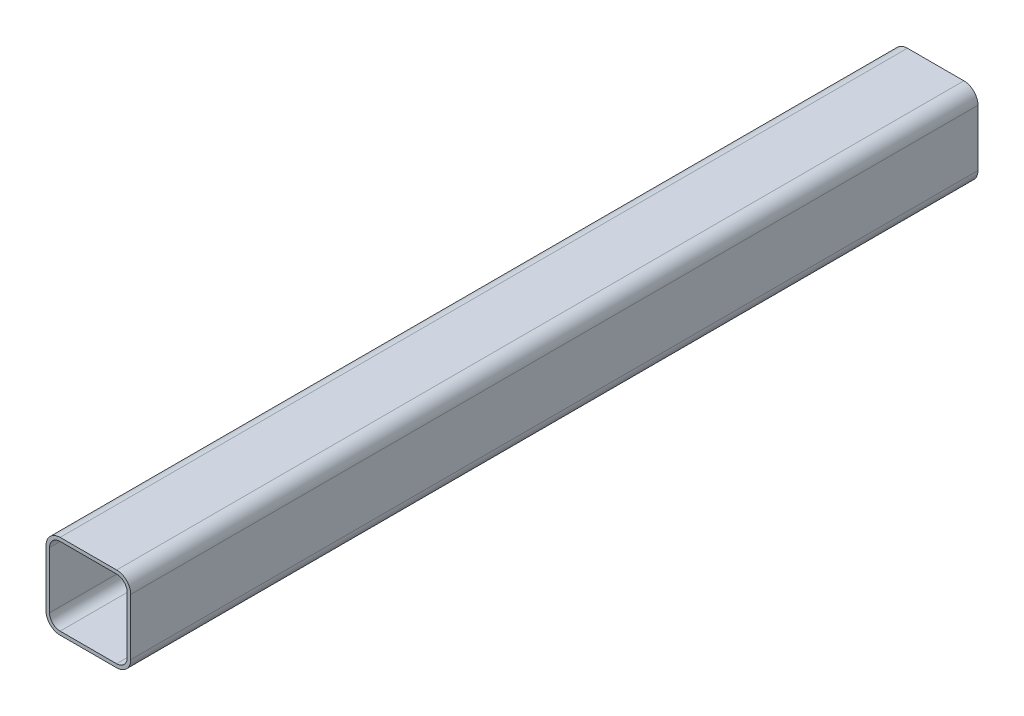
from build123d import *

# Parameters (mm, degrees)
BASE_EXTRUDE_THIN_DEPTH = 762


with BuildPart() as part:
    # Sketch1 → Base-Extrude-Thin (new body)
    with BuildSketch(Plane.XY):
        with BuildLine():
            Line((-25.4, 38.1), (25.4, 38.1))
            ThreePointArc((25.4, 38.1), (34.380256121, 34.380256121), (38.1, 25.4))
            Line((38.1, 25.4), (38.1, -25.4))
            ThreePointArc((38.1, -25.4), (34.380256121, -34.380256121), (25.4, -38.1))
            Line((25.4, -38.1), (-25.4, -38.1))
            ThreePointArc((-25.4, -38.1), (-34.380256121, -34.380256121), (-38.1, -25.4))
            Line((-38.1, -25.4), (-38.1, 25.4))
            ThreePointArc((-38.1, 25.4), (-34.380256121, 34.380256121), (-25.4, 38.1))
        make_face()
        with BuildLine():
            Line((-25.4, 34.925), (25.4, 34.925))
            ThreePointArc((25.4, 34.925), (32.135192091, 32.135192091), (34.925, 25.4))
            Line((34.925, 25.4), (34.925, -25.4))
            ThreePointArc((34.925, -25.4), (32.135192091, -32.135192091), (25.4, -34.925))
            Line((25.4, -34.925), (-25.4, -34.925))
            ThreePointArc((-25.4, -34.925), (-32.135192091, -32.135192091), (-34.925, -25.4))
            Line((-34.925, -25.4), (-34.925, 25.4))
            ThreePointArc((-34.925, 25.4), (-32.135192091, 32.135192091), (-25.4, 34.925))
        make_face(mode=Mode.SUBTRACT)
    extrude(amount=BASE_EXTRUDE_THIN_DEPTH)


solid = part.part
